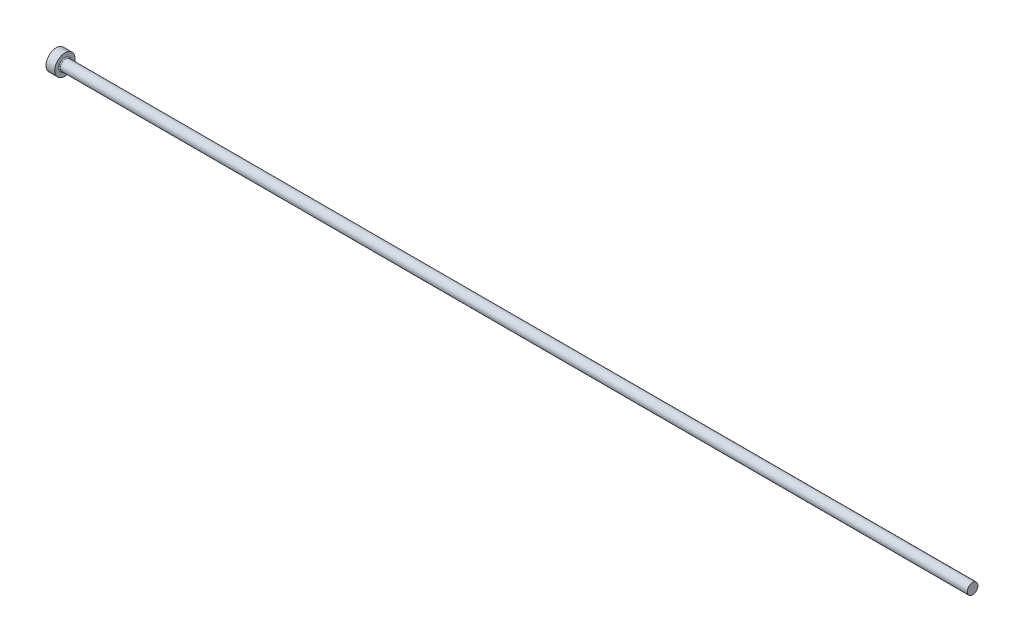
ISO-10303-21;
HEADER;
FILE_DESCRIPTION(('STEP AP214'),'2;1');
FILE_NAME('part.step','',(''),(''),'','','');
FILE_SCHEMA(('AUTOMOTIVE_DESIGN { 1 0 10303 214 1 1 1 1 }'));
ENDSEC;
DATA;
#1=APPLICATION_CONTEXT('core data for automotive mechanical design processes');
#2=APPLICATION_PROTOCOL_DEFINITION('international standard','automotive_design',2000,#1);
#3=PRODUCT_CONTEXT('',#1,'mechanical');
#4=PRODUCT('Part','Part','',(#3));
#5=PRODUCT_RELATED_PRODUCT_CATEGORY('part','',(#4));
#6=PRODUCT_DEFINITION_FORMATION('','',#4);
#7=PRODUCT_DEFINITION_CONTEXT('part definition',#1,'design');
#8=PRODUCT_DEFINITION('design','',#6,#7);
#9=PRODUCT_DEFINITION_SHAPE('','',#8);
#10=(LENGTH_UNIT() NAMED_UNIT(*) SI_UNIT(.MILLI.,.METRE.));
#11=(NAMED_UNIT(*) PLANE_ANGLE_UNIT() SI_UNIT($,.RADIAN.));
#12=(NAMED_UNIT(*) SI_UNIT($,.STERADIAN.) SOLID_ANGLE_UNIT());
#13=UNCERTAINTY_MEASURE_WITH_UNIT(LENGTH_MEASURE(1.E-05),#10,'distance_accuracy_value','');
#14=(GEOMETRIC_REPRESENTATION_CONTEXT(3) GLOBAL_UNCERTAINTY_ASSIGNED_CONTEXT((#13)) GLOBAL_UNIT_ASSIGNED_CONTEXT((#10,
#11,#12)) REPRESENTATION_CONTEXT('',''));
#15=CARTESIAN_POINT('',(0.,0.,0.));
#16=DIRECTION('',(0.,0.,1.));
#17=DIRECTION('',(1.,0.,0.));
#18=AXIS2_PLACEMENT_3D('',#15,#16,#17);
#19=CARTESIAN_POINT('',(0.,0.,0.));
#20=DIRECTION('',(-1.,0.,0.));
#21=DIRECTION('',(0.,-1.,0.));
#22=AXIS2_PLACEMENT_3D('',#19,#20,#21);
#23=PLANE('',#22);
#24=CARTESIAN_POINT('',(0.,0.,0.));
#25=DIRECTION('',(1.,0.,0.));
#26=DIRECTION('',(0.,1.,0.));
#27=AXIS2_PLACEMENT_3D('',#24,#25,#26);
#28=CIRCLE('',#27,3.5);
#29=CARTESIAN_POINT('',(0.,3.5,0.));
#30=VERTEX_POINT('',#29);
#31=EDGE_CURVE('E25',#30,#30,#28,.T.);
#32=ORIENTED_EDGE('',*,*,#31,.F.);
#33=EDGE_LOOP('',(#32));
#34=FACE_BOUND('',#33,.T.);
#35=ADVANCED_FACE('F14',(#34),#23,.T.);
#36=CARTESIAN_POINT('',(315.,0.,0.));
#37=DIRECTION('',(1.,0.,0.));
#38=DIRECTION('',(0.,1.,0.));
#39=AXIS2_PLACEMENT_3D('',#36,#37,#38);
#40=CYLINDRICAL_SURFACE('',#39,3.5);
#41=ORIENTED_EDGE('',*,*,#31,.T.);
#42=EDGE_LOOP('',(#41));
#43=FACE_BOUND('',#42,.T.);
#44=CARTESIAN_POINT('',(3.,0.,0.));
#45=DIRECTION('',(1.,0.,0.));
#46=DIRECTION('',(0.,1.,0.));
#47=AXIS2_PLACEMENT_3D('',#44,#45,#46);
#48=CIRCLE('',#47,3.5);
#49=CARTESIAN_POINT('',(3.,3.5,0.));
#50=VERTEX_POINT('',#49);
#51=EDGE_CURVE('E29',#50,#50,#48,.T.);
#52=ORIENTED_EDGE('',*,*,#51,.F.);
#53=EDGE_LOOP('',(#52));
#54=FACE_BOUND('',#53,.T.);
#55=ADVANCED_FACE('F51',(#43,#54),#40,.T.);
#56=CARTESIAN_POINT('',(3.,3.5,0.));
#57=DIRECTION('',(1.,0.,0.));
#58=DIRECTION('',(0.,1.,0.));
#59=AXIS2_PLACEMENT_3D('',#56,#57,#58);
#60=PLANE('',#59);
#61=CARTESIAN_POINT('',(3.,0.,0.));
#62=DIRECTION('',(1.,0.,0.));
#63=DIRECTION('',(0.,1.,0.));
#64=AXIS2_PLACEMENT_3D('',#61,#62,#63);
#65=CIRCLE('',#64,2.14999999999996);
#66=CARTESIAN_POINT('',(3.,2.14999999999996,0.));
#67=VERTEX_POINT('',#66);
#68=EDGE_CURVE('E9',#67,#67,#65,.F.);
#69=ORIENTED_EDGE('',*,*,#68,.T.);
#70=EDGE_LOOP('',(#69));
#71=FACE_BOUND('',#70,.T.);
#72=ORIENTED_EDGE('',*,*,#51,.T.);
#73=EDGE_LOOP('',(#72));
#74=FACE_BOUND('',#73,.T.);
#75=ADVANCED_FACE('F42',(#71,#74),#60,.T.);
#76=CARTESIAN_POINT('',(315.,0.,0.));
#77=DIRECTION('',(1.,0.,0.));
#78=DIRECTION('',(0.,1.,0.));
#79=AXIS2_PLACEMENT_3D('',#76,#77,#78);
#80=CYLINDRICAL_SURFACE('',#79,1.84999999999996);
#81=CARTESIAN_POINT('',(3.3,0.,0.));
#82=DIRECTION('',(1.,0.,0.));
#83=DIRECTION('',(0.,1.,0.));
#84=AXIS2_PLACEMENT_3D('',#81,#82,#83);
#85=CIRCLE('',#84,1.84999999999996);
#86=CARTESIAN_POINT('',(3.3,1.84999999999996,0.));
#87=VERTEX_POINT('',#86);
#88=EDGE_CURVE('E21',#87,#87,#85,.T.);
#89=ORIENTED_EDGE('',*,*,#88,.T.);
#90=EDGE_LOOP('',(#89));
#91=FACE_BOUND('',#90,.T.);
#92=CARTESIAN_POINT('',(315.,0.,0.));
#93=DIRECTION('',(1.,0.,0.));
#94=DIRECTION('',(0.,1.,0.));
#95=AXIS2_PLACEMENT_3D('',#92,#93,#94);
#96=CIRCLE('',#95,1.84999999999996);
#97=CARTESIAN_POINT('',(315.,1.84999999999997,0.));
#98=VERTEX_POINT('',#97);
#99=EDGE_CURVE('E34',#98,#98,#96,.T.);
#100=ORIENTED_EDGE('',*,*,#99,.F.);
#101=EDGE_LOOP('',(#100));
#102=FACE_BOUND('',#101,.T.);
#103=ADVANCED_FACE('F40',(#91,#102),#80,.T.);
#104=CARTESIAN_POINT('',(315.,1.84999999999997,0.));
#105=DIRECTION('',(1.,0.,0.));
#106=DIRECTION('',(0.,1.,0.));
#107=AXIS2_PLACEMENT_3D('',#104,#105,#106);
#108=PLANE('',#107);
#109=ORIENTED_EDGE('',*,*,#99,.T.);
#110=EDGE_LOOP('',(#109));
#111=FACE_BOUND('',#110,.T.);
#112=ADVANCED_FACE('F38',(#111),#108,.T.);
#113=CARTESIAN_POINT('',(3.3,0.,0.));
#114=DIRECTION('',(1.,0.,0.));
#115=DIRECTION('',(0.,1.,0.));
#116=AXIS2_PLACEMENT_3D('',#113,#114,#115);
#117=TOROIDAL_SURFACE('',#116,2.14999999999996,0.3);
#118=ORIENTED_EDGE('',*,*,#68,.F.);
#119=EDGE_LOOP('',(#118));
#120=FACE_BOUND('',#119,.T.);
#121=ORIENTED_EDGE('',*,*,#88,.F.);
#122=EDGE_LOOP('',(#121));
#123=FACE_BOUND('',#122,.T.);
#124=ADVANCED_FACE('F16',(#120,#123),#117,.F.);
#125=CLOSED_SHELL('',(#35,#55,#75,#103,#112,#124));
#126=MANIFOLD_SOLID_BREP('B1',#125);
#127=ADVANCED_BREP_SHAPE_REPRESENTATION('',(#18,#126),#14);
#128=SHAPE_DEFINITION_REPRESENTATION(#9,#127);
ENDSEC;
END-ISO-10303-21;
